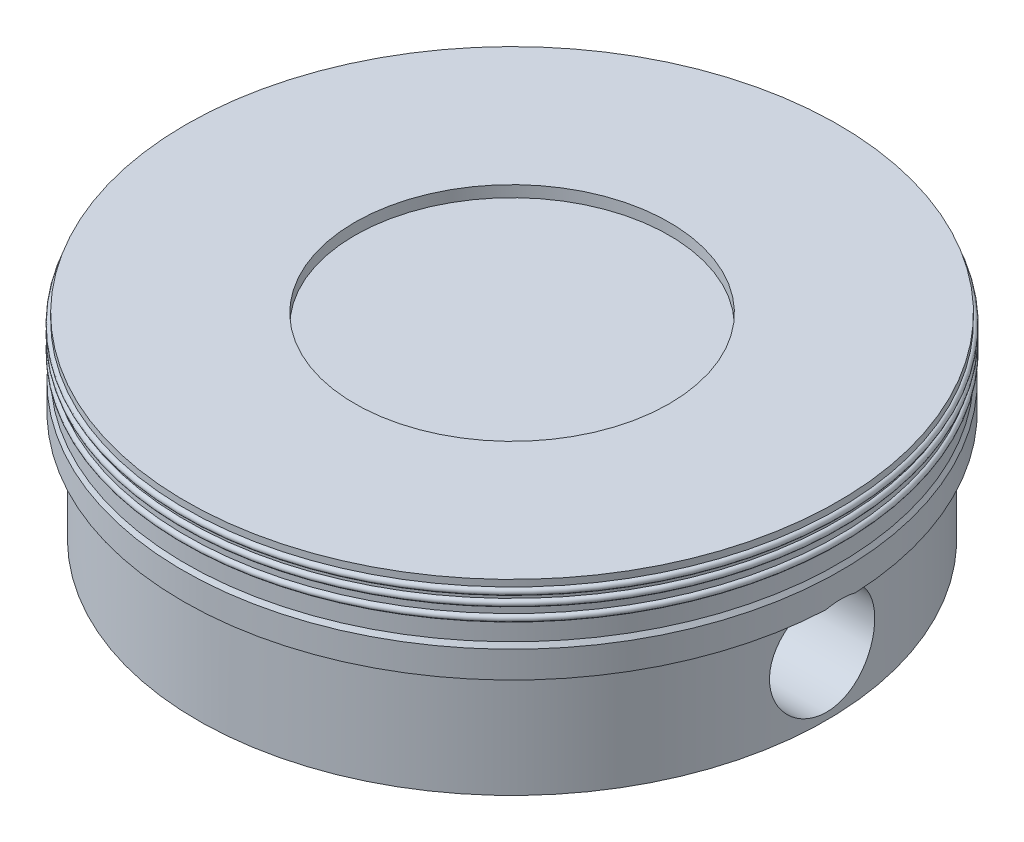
from build123d import *

# Parameters (mm, degrees)
EXTRUDE_1_REACH          = 9.683
CUT_EXTRUDE_1_DEPTH      = 8.683292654
CUT_EXTRUDE_1_DEPTH_BACK = 8.683292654
SKETCH_4_R               = 0.8


with BuildPart() as part:
    # Sketch 1 → Revolve 1 (revolve)
    with BuildSketch(Plane.XY, mode=Mode.PRIVATE) as revolve_1_sk:
        with BuildLine():
            Line((4.78, 0), (3.43, 0))
            Line((3.43, 0), (3.43, 1.93))
            Line((3.43, 1.93), (4.2, 1.93))
            Line((4.2, 1.93), (4.2, 2.33))
            Line((4.2, 2.33), (0, 2.33))
            Line((0, 2.33), (0, 2.8))
            Line((0, 2.8), (2.39, 2.8))
            Line((2.39, 2.8), (2.39, 2.972))
            Line((2.39, 2.972), (4.96, 2.972))
            Line((4.96, 2.972), (4.96, 2.872))
            ThreePointArc((4.96, 2.872), (5.01, 2.822), (4.96, 2.772))
            Line((4.96, 2.772), (4.96, 2.722))
            ThreePointArc((4.96, 2.722), (5.01, 2.672), (4.96, 2.622))
            Line((4.96, 2.622), (4.96, 2.522))
            ThreePointArc((4.96, 2.522), (5.01, 2.472), (4.96, 2.422))
            Line((4.96, 2.422), (4.96, 2.15067161))
            Line((4.96, 2.15067161), (5, 2.08067161))
            Line((5, 2.08067161), (5, 1.675))
            Line((5, 1.675), (4.78, 1.675))
            Line((4.78, 1.675), (4.78, 0))
        make_face()
    revolve(revolve_1_sk.sketch.rotate(Axis((0, 3, 0), (0, -1, 0)), 180), axis=Axis((0, 3, 0), (0, -1, 0)))

    # Sketch 3 → Extrude 1 (add, up to next)
    with BuildSketch(Plane.XZ, mode=Mode.PRIVATE) as extrude_1_sk1:
        with BuildLine():
            Line((-1.75, 2.949983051), (-1.75, -2.949983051))
            ThreePointArc((-1.75, -2.949983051), (-3.43, 0), (-1.75, 2.949983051))
        make_face()
    extrude_1_tool1 = extrude(extrude_1_sk1.sketch, amount=-EXTRUDE_1_REACH, mode=Mode.PRIVATE) - part.part
    # Sketch 3 → Extrude 1 (add, up to next)
    with BuildSketch(Plane.XZ, mode=Mode.PRIVATE) as extrude_1_sk2:
        with BuildLine():
            Line((1.75, 2.949983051), (1.75, -2.949983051))
            ThreePointArc((1.75, -2.949983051), (3.43, 0), (1.75, 2.949983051))
        make_face()
    extrude_1_tool2 = extrude(extrude_1_sk2.sketch, amount=-EXTRUDE_1_REACH, mode=Mode.PRIVATE) - part.part
    add(extrude_1_tool1.solids().sort_by_distance((-2.438465, 0, 0))[0])
    add(extrude_1_tool2.solids().sort_by_distance((2.438465, 0, 0))[0])

    # Sketch 4 → Cut-Extrude 1 (cut, two sides: drawn at the far end of the back side and taken through both)
    with BuildSketch(Plane(origin=(0, 0, 0), x_dir=(0, 0, -1), z_dir=(1, 0, 0)).offset(-CUT_EXTRUDE_1_DEPTH_BACK)):
        with Locations(Location((0, 0.9065, 0), (0, 0, 73.86818093))):
            Circle(SKETCH_4_R)
    extrude(amount=CUT_EXTRUDE_1_DEPTH + CUT_EXTRUDE_1_DEPTH_BACK, mode=Mode.SUBTRACT)


solid = part.part
